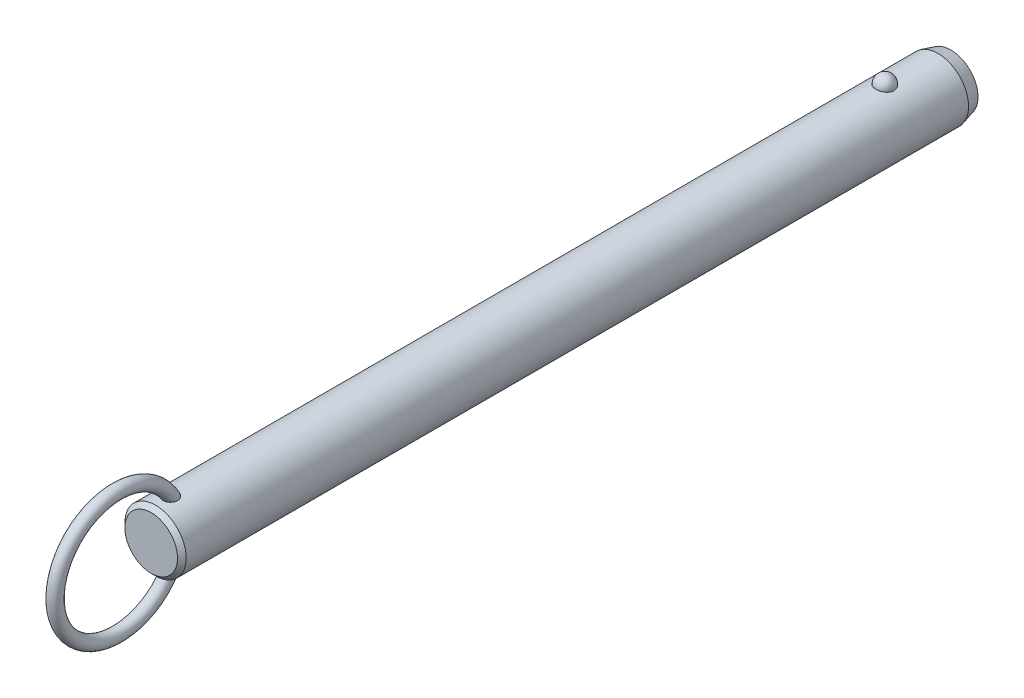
ISO-10303-21;
HEADER;
FILE_DESCRIPTION(('STEP AP214'),'2;1');
FILE_NAME('part.step','',(''),(''),'','','');
FILE_SCHEMA(('AUTOMOTIVE_DESIGN { 1 0 10303 214 1 1 1 1 }'));
ENDSEC;
DATA;
#1=APPLICATION_CONTEXT('core data for automotive mechanical design processes');
#2=APPLICATION_PROTOCOL_DEFINITION('international standard','automotive_design',2000,#1);
#3=PRODUCT_CONTEXT('',#1,'mechanical');
#4=PRODUCT('Part','Part','',(#3));
#5=PRODUCT_RELATED_PRODUCT_CATEGORY('part','',(#4));
#6=PRODUCT_DEFINITION_FORMATION('','',#4);
#7=PRODUCT_DEFINITION_CONTEXT('part definition',#1,'design');
#8=PRODUCT_DEFINITION('design','',#6,#7);
#9=PRODUCT_DEFINITION_SHAPE('','',#8);
#10=(LENGTH_UNIT() NAMED_UNIT(*) SI_UNIT(.MILLI.,.METRE.));
#11=(NAMED_UNIT(*) PLANE_ANGLE_UNIT() SI_UNIT($,.RADIAN.));
#12=(NAMED_UNIT(*) SI_UNIT($,.STERADIAN.) SOLID_ANGLE_UNIT());
#13=UNCERTAINTY_MEASURE_WITH_UNIT(LENGTH_MEASURE(1.E-05),#10,'distance_accuracy_value','');
#14=(GEOMETRIC_REPRESENTATION_CONTEXT(3) GLOBAL_UNCERTAINTY_ASSIGNED_CONTEXT((#13)) GLOBAL_UNIT_ASSIGNED_CONTEXT((#10,
#11,#12)) REPRESENTATION_CONTEXT('',''));
#15=CARTESIAN_POINT('',(0.,0.,0.));
#16=DIRECTION('',(0.,0.,1.));
#17=DIRECTION('',(1.,0.,0.));
#18=AXIS2_PLACEMENT_3D('',#15,#16,#17);
#19=CARTESIAN_POINT('',(0.,0.,160.));
#20=DIRECTION('',(0.,0.,-1.));
#21=DIRECTION('',(-1.,0.,0.));
#22=AXIS2_PLACEMENT_3D('',#19,#20,#21);
#23=CYLINDRICAL_SURFACE('',#22,7.1);
#24=CARTESIAN_POINT('',(2.0769088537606,6.78943661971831,-2.1));
#25=CARTESIAN_POINT('',(2.07690739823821,6.78943796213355,-1.98268154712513));
#26=CARTESIAN_POINT('',(2.06738130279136,6.79237331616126,-1.86534506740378));
#27=CARTESIAN_POINT('',(2.0295040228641,6.8037853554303,-1.63400788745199));
#28=CARTESIAN_POINT('',(2.00114757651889,6.81226358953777,-1.52000812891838));
#29=CARTESIAN_POINT('',(1.92632025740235,6.83379798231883,-1.29863433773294));
#30=CARTESIAN_POINT('',(1.87985726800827,6.84685214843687,-1.19125744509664));
#31=CARTESIAN_POINT('',(1.76995205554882,6.87608091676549,-0.98604657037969));
#32=CARTESIAN_POINT('',(1.70650980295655,6.8922555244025,-0.88821260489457));
#33=CARTESIAN_POINT('',(1.5638119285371,6.92602930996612,-0.704242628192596));
#34=CARTESIAN_POINT('',(1.4844714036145,6.94363582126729,-0.618173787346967));
#35=CARTESIAN_POINT('',(1.31221746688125,6.97823658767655,-0.460740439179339));
#36=CARTESIAN_POINT('',(1.21930409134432,6.99523084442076,-0.389375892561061));
#37=CARTESIAN_POINT('',(1.02268781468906,7.02666176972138,-0.263547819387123));
#38=CARTESIAN_POINT('',(0.91902009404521,7.04110638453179,-0.209031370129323));
#39=CARTESIAN_POINT('',(0.703548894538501,7.06588726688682,-0.118163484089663));
#40=CARTESIAN_POINT('',(0.591746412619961,7.07622403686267,-0.0818098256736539));
#41=CARTESIAN_POINT('',(0.365557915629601,7.09147068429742,-0.0288711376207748));
#42=CARTESIAN_POINT('',(0.251267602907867,7.09648447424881,-0.0119070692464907));
#43=CARTESIAN_POINT('',(0.0213499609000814,7.10089837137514,0.00304925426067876));
#44=CARTESIAN_POINT('',(-0.0942772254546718,7.10029907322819,0.00104351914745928));
#45=CARTESIAN_POINT('',(-0.321651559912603,7.09360829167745,-0.0216931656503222));
#46=CARTESIAN_POINT('',(-0.433431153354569,7.08760388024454,-0.0421272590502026));
#47=CARTESIAN_POINT('',(-0.651862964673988,7.07086131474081,-0.100729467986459));
#48=CARTESIAN_POINT('',(-0.758515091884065,7.06012307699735,-0.138897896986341));
#49=CARTESIAN_POINT('',(-0.964449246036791,7.03496097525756,-0.232213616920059));
#50=CARTESIAN_POINT('',(-1.06368095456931,7.02051445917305,-0.287465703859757));
#51=CARTESIAN_POINT('',(-1.25145353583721,6.98948740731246,-0.413383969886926));
#52=CARTESIAN_POINT('',(-1.33999321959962,6.97290663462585,-0.48405186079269));
#53=CARTESIAN_POINT('',(-1.50591604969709,6.93898770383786,-0.640594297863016));
#54=CARTESIAN_POINT('',(-1.58302488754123,6.92164094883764,-0.726757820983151));
#55=CARTESIAN_POINT('',(-1.72189320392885,6.8884103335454,-0.91092752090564));
#56=CARTESIAN_POINT('',(-1.78365144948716,6.87252659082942,-1.008934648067));
#57=CARTESIAN_POINT('',(-1.89101272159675,6.84377189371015,-1.21549497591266));
#58=CARTESIAN_POINT('',(-1.93639553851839,6.83094274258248,-1.32416860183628));
#59=CARTESIAN_POINT('',(-2.00874275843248,6.81002070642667,-1.54791500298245));
#60=CARTESIAN_POINT('',(-2.03570774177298,6.80192767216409,-1.66298757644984));
#61=CARTESIAN_POINT('',(-2.07047276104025,6.7914266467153,-1.89571453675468));
#62=CARTESIAN_POINT('',(-2.07835878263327,6.78899315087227,-2.01335491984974));
#63=CARTESIAN_POINT('',(-2.07502083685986,6.79001409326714,-2.24833570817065));
#64=CARTESIAN_POINT('',(-2.06379746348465,6.7934683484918,-2.36567612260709));
#65=CARTESIAN_POINT('',(-2.02263913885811,6.80583442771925,-2.59603194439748));
#66=CARTESIAN_POINT('',(-1.99281127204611,6.81471501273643,-2.70906820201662));
#67=CARTESIAN_POINT('',(-1.91526639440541,6.83691232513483,-2.92836575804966));
#68=CARTESIAN_POINT('',(-1.8675486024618,6.85022924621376,-3.03462676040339));
#69=CARTESIAN_POINT('',(-1.75504492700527,6.87991336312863,-3.23806487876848));
#70=CARTESIAN_POINT('',(-1.69015924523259,6.89629822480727,-3.33518422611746));
#71=CARTESIAN_POINT('',(-1.54505404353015,6.93024852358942,-3.51697105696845));
#72=CARTESIAN_POINT('',(-1.46483385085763,6.94781401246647,-3.60163799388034));
#73=CARTESIAN_POINT('',(-1.29071406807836,6.98225977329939,-3.75654119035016));
#74=CARTESIAN_POINT('',(-1.19675650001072,6.99913673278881,-3.82671308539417));
#75=CARTESIAN_POINT('',(-0.997940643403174,7.03023618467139,-3.9501837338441));
#76=CARTESIAN_POINT('',(-0.89308318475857,7.04445887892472,-4.00348377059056));
#77=CARTESIAN_POINT('',(-0.676902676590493,7.06848365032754,-4.09107242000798));
#78=CARTESIAN_POINT('',(-0.565686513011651,7.0783430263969,-4.12560889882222));
#79=CARTESIAN_POINT('',(-0.338739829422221,7.09282534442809,-4.17575450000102));
#80=CARTESIAN_POINT('',(-0.223009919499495,7.09744899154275,-4.19136617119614));
#81=CARTESIAN_POINT('',(0.00707628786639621,7.10090930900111,-4.20307965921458));
#82=CARTESIAN_POINT('',(0.121410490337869,7.09986531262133,-4.19958377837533));
#83=CARTESIAN_POINT('',(0.347815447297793,7.092380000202,-4.17411564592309));
#84=CARTESIAN_POINT('',(0.459886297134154,7.08593891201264,-4.15214417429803));
#85=CARTESIAN_POINT('',(0.678084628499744,7.06838983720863,-4.09049562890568));
#86=CARTESIAN_POINT('',(0.784237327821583,7.05730369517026,-4.05090137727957));
#87=CARTESIAN_POINT('',(0.988305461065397,7.03163139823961,-3.95511447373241));
#88=CARTESIAN_POINT('',(1.08622031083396,7.01704499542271,-3.89892064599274));
#89=CARTESIAN_POINT('',(1.27284490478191,6.98562668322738,-3.77035541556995));
#90=CARTESIAN_POINT('',(1.36137372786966,6.96876135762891,-3.69772964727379));
#91=CARTESIAN_POINT('',(1.52509486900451,6.93477412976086,-3.53878279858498));
#92=CARTESIAN_POINT('',(1.60028496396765,6.91765218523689,-3.45245943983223));
#93=CARTESIAN_POINT('',(1.73681688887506,6.88465753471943,-3.26658774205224));
#94=CARTESIAN_POINT('',(1.79785966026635,6.86881574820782,-3.16681408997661));
#95=CARTESIAN_POINT('',(1.90265327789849,6.84053157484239,-2.95814408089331));
#96=CARTESIAN_POINT('',(1.94640861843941,6.82808830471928,-2.84925010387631));
#97=CARTESIAN_POINT('',(2.01274378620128,6.80881460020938,-2.63454318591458));
#98=CARTESIAN_POINT('',(2.03676193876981,6.80160856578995,-2.52920574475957));
#99=CARTESIAN_POINT('',(2.06884490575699,6.79191902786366,-2.3159172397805));
#100=CARTESIAN_POINT('',(2.07691019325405,6.78943538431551,-2.20796625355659));
#101=CARTESIAN_POINT('',(2.0769088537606,6.78943661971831,-2.1));
#102=B_SPLINE_CURVE_WITH_KNOTS('',3,(#24,#25,#26,#27,#28,#29,#30,#31,#32,#33,#34,#35,#36,#37,
#38,#39,#40,#41,#42,#43,#44,#45,#46,#47,#48,#49,#50,#51,#52,#53,#54,#55,#56,#57,#58,#59,#60,#61,
#62,#63,#64,#65,#66,#67,#68,#69,#70,#71,#72,#73,#74,#75,#76,#77,#78,#79,#80,#81,#82,#83,#84,#85,
#86,#87,#88,#89,#90,#91,#92,#93,#94,#95,#96,#97,#98,#99,#100,#101),.UNSPECIFIED.,.T.,.F.,(4,2,2,
2,2,2,2,2,2,2,2,2,2,2,2,2,2,2,2,2,2,2,2,2,2,2,2,2,2,2,2,2,2,2,2,2,2,2,4),(0.,0.351568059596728,
0.703234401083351,1.05474780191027,1.40626181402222,1.75970563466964,2.11314851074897,
2.4654696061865,2.81774759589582,3.16301449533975,3.50824481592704,3.84801136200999,
4.18778391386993,4.52968352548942,4.87162112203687,5.22076181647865,5.56993054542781,
5.92363364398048,6.27732559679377,6.62942052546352,6.98150450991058,7.33158042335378,
7.68167162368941,8.03384443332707,8.38603269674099,8.73975272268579,9.09344583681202,
9.44234545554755,9.79119807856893,10.1327344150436,10.4742563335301,10.8141898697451,
11.1541474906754,11.4997793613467,11.8454687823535,12.1979079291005,12.5502553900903,
12.8738073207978,13.1973496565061),.UNSPECIFIED.);
#103=CARTESIAN_POINT('',(2.0769088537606,6.78943661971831,-2.1));
#104=VERTEX_POINT('',#103);
#105=EDGE_CURVE('E41',#104,#104,#102,.T.);
#106=ORIENTED_EDGE('',*,*,#105,.T.);
#107=EDGE_LOOP('',(#106));
#108=FACE_BOUND('',#107,.T.);
#109=CARTESIAN_POINT('',(0.,0.,166.92));
#110=DIRECTION('',(0.,0.,1.));
#111=DIRECTION('',(1.,0.,0.));
#112=AXIS2_PLACEMENT_3D('',#109,#110,#111);
#113=CIRCLE('',#112,7.1);
#114=CARTESIAN_POINT('',(7.1,0.,166.92));
#115=VERTEX_POINT('',#114);
#116=EDGE_CURVE('E10',#115,#115,#113,.F.);
#117=ORIENTED_EDGE('',*,*,#116,.T.);
#118=EDGE_LOOP('',(#117));
#119=FACE_BOUND('',#118,.T.);
#120=CARTESIAN_POINT('',(-0.429539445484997,-7.08699541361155,161.742921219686));
#121=CARTESIAN_POINT('',(-0.508331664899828,-7.08221999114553,161.766876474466));
#122=CARTESIAN_POINT('',(-0.585039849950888,-7.07624016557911,161.797457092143));
#123=CARTESIAN_POINT('',(-0.73208265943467,-7.06254296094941,161.871024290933));
#124=CARTESIAN_POINT('',(-0.802417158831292,-7.05482554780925,161.914011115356));
#125=CARTESIAN_POINT('',(-0.934722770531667,-7.03851844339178,162.011113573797));
#126=CARTESIAN_POINT('',(-0.996700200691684,-7.02992941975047,162.065220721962));
#127=CARTESIAN_POINT('',(-1.11079942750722,-7.01280697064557,162.182967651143));
#128=CARTESIAN_POINT('',(-1.16292136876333,-7.00427354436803,162.246607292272));
#129=CARTESIAN_POINT('',(-1.25705660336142,-6.98799959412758,162.382687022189));
#130=CARTESIAN_POINT('',(-1.29888032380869,-6.98027525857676,162.455259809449));
#131=CARTESIAN_POINT('',(-1.37069920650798,-6.96652886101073,162.606168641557));
#132=CARTESIAN_POINT('',(-1.40069157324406,-6.96050720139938,162.684506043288));
#133=CARTESIAN_POINT('',(-1.45043507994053,-6.95031881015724,162.850190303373));
#134=CARTESIAN_POINT('',(-1.46937115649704,-6.94630231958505,162.937789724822));
#135=CARTESIAN_POINT('',(-1.49424917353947,-6.94099239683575,163.114871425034));
#136=CARTESIAN_POINT('',(-1.50018601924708,-6.93970003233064,163.204354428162));
#137=CARTESIAN_POINT('',(-1.49978214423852,-6.93978815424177,163.394060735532));
#138=CARTESIAN_POINT('',(-1.49187639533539,-6.94150934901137,163.494279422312));
#139=CARTESIAN_POINT('',(-1.46177925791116,-6.94790814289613,163.692479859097));
#140=CARTESIAN_POINT('',(-1.43957541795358,-6.95258831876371,163.790459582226));
#141=CARTESIAN_POINT('',(-1.37783293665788,-6.96510647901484,163.99536292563));
#142=CARTESIAN_POINT('',(-1.33634073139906,-6.97328848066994,164.101680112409));
#143=CARTESIAN_POINT('',(-1.23686994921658,-6.99161706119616,164.306177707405));
#144=CARTESIAN_POINT('',(-1.17889192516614,-7.00176357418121,164.404358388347));
#145=CARTESIAN_POINT('',(-1.05875124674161,-7.02082898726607,164.572374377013));
#146=CARTESIAN_POINT('',(-0.999247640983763,-7.02963746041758,164.644123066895));
#147=CARTESIAN_POINT('',(-0.869494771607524,-7.04686074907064,164.777195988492));
#148=CARTESIAN_POINT('',(-0.799263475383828,-7.05527619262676,164.838537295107));
#149=CARTESIAN_POINT('',(-0.665408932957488,-7.06899457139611,164.935131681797));
#150=CARTESIAN_POINT('',(-0.603817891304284,-7.07457275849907,164.973151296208));
#151=CARTESIAN_POINT('',(-0.475172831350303,-7.08437420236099,165.038758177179));
#152=CARTESIAN_POINT('',(-0.408123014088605,-7.08859848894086,165.066353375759));
#153=CARTESIAN_POINT('',(-0.269431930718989,-7.09522749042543,165.109256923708));
#154=CARTESIAN_POINT('',(-0.197757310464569,-7.09761688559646,165.124461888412));
#155=CARTESIAN_POINT('',(-0.0527849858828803,-7.10017268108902,165.140716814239));
#156=CARTESIAN_POINT('',(0.0205115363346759,-7.10034065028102,165.141776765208));
#157=CARTESIAN_POINT('',(0.156426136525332,-7.09855986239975,165.130461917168));
#158=CARTESIAN_POINT('',(0.219199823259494,-7.09688191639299,165.119806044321));
#159=CARTESIAN_POINT('',(0.342134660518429,-7.09201880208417,165.088537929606));
#160=CARTESIAN_POINT('',(0.402295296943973,-7.08883333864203,165.067923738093));
#161=CARTESIAN_POINT('',(0.520687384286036,-7.08113868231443,165.017212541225));
#162=CARTESIAN_POINT('',(0.578791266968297,-7.07658958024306,164.986827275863));
#163=CARTESIAN_POINT('',(0.690173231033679,-7.06659708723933,164.918367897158));
#164=CARTESIAN_POINT('',(0.743447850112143,-7.061153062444,164.880288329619));
#165=CARTESIAN_POINT('',(0.870947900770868,-7.04680292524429,164.776592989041));
#166=CARTESIAN_POINT('',(0.941828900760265,-7.03755800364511,164.706897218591));
#167=CARTESIAN_POINT('',(1.07136606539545,-7.01900793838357,164.556945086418));
#168=CARTESIAN_POINT('',(1.13000013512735,-7.00970271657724,164.476670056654));
#169=CARTESIAN_POINT('',(1.23579584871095,-6.99183327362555,164.306899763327));
#170=CARTESIAN_POINT('',(1.28274271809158,-6.98328455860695,164.217269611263));
#171=CARTESIAN_POINT('',(1.36351442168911,-6.96796352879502,164.032176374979));
#172=CARTESIAN_POINT('',(1.39733971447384,-6.96119115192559,163.936713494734));
#173=CARTESIAN_POINT('',(1.45579181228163,-6.94922464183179,163.72530928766));
#174=CARTESIAN_POINT('',(1.47790145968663,-6.94449000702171,163.608631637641));
#175=CARTESIAN_POINT('',(1.50168752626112,-6.93938731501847,163.373015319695));
#176=CARTESIAN_POINT('',(1.50336085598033,-6.93901991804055,163.25407631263));
#177=CARTESIAN_POINT('',(1.48486516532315,-6.9430010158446,163.02360799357));
#178=CARTESIAN_POINT('',(1.46573441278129,-6.9471253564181,162.911995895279));
#179=CARTESIAN_POINT('',(1.40606892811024,-6.95944667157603,162.694886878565));
#180=CARTESIAN_POINT('',(1.36556446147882,-6.96763788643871,162.5893815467));
#181=CARTESIAN_POINT('',(1.2708270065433,-6.98548038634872,162.404287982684));
#182=CARTESIAN_POINT('',(1.21949810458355,-6.99473841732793,162.323171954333));
#183=CARTESIAN_POINT('',(1.10242050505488,-7.01414069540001,162.172227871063));
#184=CARTESIAN_POINT('',(1.03668119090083,-7.02428436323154,162.10239252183));
#185=CARTESIAN_POINT('',(0.900559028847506,-7.04295285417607,161.983573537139));
#186=CARTESIAN_POINT('',(0.831428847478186,-7.05153466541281,161.933157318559));
#187=CARTESIAN_POINT('',(0.685291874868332,-7.06723150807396,161.845142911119));
#188=CARTESIAN_POINT('',(0.608287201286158,-7.07434693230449,161.807541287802));
#189=CARTESIAN_POINT('',(0.451878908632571,-7.08602232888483,161.747491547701));
#190=CARTESIAN_POINT('',(0.372686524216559,-7.09067127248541,161.724508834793));
#191=CARTESIAN_POINT('',(0.21147739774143,-7.09730788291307,161.692035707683));
#192=CARTESIAN_POINT('',(0.129460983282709,-7.09929585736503,161.68254373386));
#193=CARTESIAN_POINT('',(-0.0332905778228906,-7.10037858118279,161.677351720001));
#194=CARTESIAN_POINT('',(-0.114016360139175,-7.09953334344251,161.681365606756));
#195=CARTESIAN_POINT('',(-0.273670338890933,-7.09517338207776,161.702454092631));
#196=CARTESIAN_POINT('',(-0.352598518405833,-7.09165863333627,161.719528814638));
#197=CARTESIAN_POINT('',(-0.429539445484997,-7.08699541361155,161.742921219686));
#198=B_SPLINE_CURVE_WITH_KNOTS('',3,(#120,#121,#122,#123,#124,#125,#126,#127,#128,#129,#130,
#131,#132,#133,#134,#135,#136,#137,#138,#139,#140,#141,#142,#143,#144,#145,#146,#147,#148,#149,
#150,#151,#152,#153,#154,#155,#156,#157,#158,#159,#160,#161,#162,#163,#164,#165,#166,#167,#168,
#169,#170,#171,#172,#173,#174,#175,#176,#177,#178,#179,#180,#181,#182,#183,#184,#185,#186,#187,
#188,#189,#190,#191,#192,#193,#194,#195,#196,#197),.UNSPECIFIED.,.T.,.F.,(4,2,2,2,2,2,2,2,2,2,2,
2,2,2,2,2,2,2,2,2,2,2,2,2,2,2,2,2,2,2,2,2,2,2,2,2,2,2,4),(0.,0.247183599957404,
0.494372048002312,0.741372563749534,0.988369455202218,1.23962059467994,1.490931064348,
1.75897818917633,2.02713035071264,2.32758265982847,2.62829697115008,2.97008736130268,
3.31186629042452,3.59175319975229,3.87117637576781,4.08813841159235,4.30493502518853,
4.5235225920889,4.74195577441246,4.93215328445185,5.12238804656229,5.31884850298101,
5.51544871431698,5.81332317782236,6.11173048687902,6.41527266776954,6.71880423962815,
7.07358156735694,7.42841252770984,7.76631485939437,8.10373999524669,8.39142246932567,
8.67891817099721,8.93560332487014,9.19221962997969,9.43881106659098,9.68537399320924,
9.92674752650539,10.1681233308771),.UNSPECIFIED.);
#199=CARTESIAN_POINT('',(-0.429539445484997,-7.08699541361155,161.742921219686));
#200=VERTEX_POINT('',#199);
#201=EDGE_CURVE('E60',#200,#200,#198,.T.);
#202=ORIENTED_EDGE('',*,*,#201,.T.);
#203=EDGE_LOOP('',(#202));
#204=FACE_BOUND('',#203,.T.);
#205=CARTESIAN_POINT('',(-0.429539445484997,7.08699541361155,161.742921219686));
#206=CARTESIAN_POINT('',(-0.351665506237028,7.09171429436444,161.719246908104));
#207=CARTESIAN_POINT('',(-0.271733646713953,7.09525896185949,161.702036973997));
#208=CARTESIAN_POINT('',(-0.110026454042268,7.09960839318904,161.681005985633));
#209=CARTESIAN_POINT('',(-0.0282502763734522,7.10041187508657,161.677191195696));
#210=CARTESIAN_POINT('',(0.134782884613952,7.09918849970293,161.683059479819));
#211=CARTESIAN_POINT('',(0.216039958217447,7.09716214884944,161.69274013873));
#212=CARTESIAN_POINT('',(0.375730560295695,7.09050177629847,161.725347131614));
#213=CARTESIAN_POINT('',(0.454164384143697,7.08586802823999,161.748272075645));
#214=CARTESIAN_POINT('',(0.606025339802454,7.07449911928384,161.806771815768));
#215=CARTESIAN_POINT('',(0.67945100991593,7.06776334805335,161.842350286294));
#216=CARTESIAN_POINT('',(0.819234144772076,7.05292866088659,161.925175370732));
#217=CARTESIAN_POINT('',(0.88559181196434,7.04482978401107,161.972421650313));
#218=CARTESIAN_POINT('',(1.00993211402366,7.02808709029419,162.077590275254));
#219=CARTESIAN_POINT('',(1.06785399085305,7.01943990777,162.135583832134));
#220=CARTESIAN_POINT('',(1.17342527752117,7.00256662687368,162.260301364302));
#221=CARTESIAN_POINT('',(1.22107408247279,6.99434055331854,162.327025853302));
#222=CARTESIAN_POINT('',(1.30652927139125,6.97889183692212,162.469362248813));
#223=CARTESIAN_POINT('',(1.34399711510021,6.97170674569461,162.545180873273));
#224=CARTESIAN_POINT('',(1.40682616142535,6.95930080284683,162.701810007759));
#225=CARTESIAN_POINT('',(1.43218374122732,6.95408053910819,162.78262200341));
#226=CARTESIAN_POINT('',(1.47246409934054,6.94566853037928,162.953531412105));
#227=CARTESIAN_POINT('',(1.48642590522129,6.9426653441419,163.04386307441));
#228=CARTESIAN_POINT('',(1.5011410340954,6.93949744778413,163.225619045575));
#229=CARTESIAN_POINT('',(1.50188917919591,6.93933385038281,163.317043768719));
#230=CARTESIAN_POINT('',(1.49030464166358,6.94183245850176,163.51084381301));
#231=CARTESIAN_POINT('',(1.47627413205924,6.94486147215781,163.613112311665));
#232=CARTESIAN_POINT('',(1.43356351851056,6.95380194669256,163.814471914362));
#233=CARTESIAN_POINT('',(1.4048676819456,6.95971650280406,163.913559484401));
#234=CARTESIAN_POINT('',(1.32908750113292,6.97461208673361,164.118908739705));
#235=CARTESIAN_POINT('',(1.28011435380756,6.98388945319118,164.224456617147));
#236=CARTESIAN_POINT('',(1.16520357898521,7.00397743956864,164.425760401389));
#237=CARTESIAN_POINT('',(1.09927694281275,7.01478706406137,164.521522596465));
#238=CARTESIAN_POINT('',(0.969361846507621,7.03373936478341,164.676756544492));
#239=CARTESIAN_POINT('',(0.909042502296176,7.04187023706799,164.739303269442));
#240=CARTESIAN_POINT('',(0.779178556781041,7.05741732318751,164.854053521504));
#241=CARTESIAN_POINT('',(0.709649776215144,7.06483472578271,164.906274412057));
#242=CARTESIAN_POINT('',(0.576854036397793,7.0767751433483,164.988113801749));
#243=CARTESIAN_POINT('',(0.515118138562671,7.08158033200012,165.020164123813));
#244=CARTESIAN_POINT('',(0.387127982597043,7.08972701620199,165.073765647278));
#245=CARTESIAN_POINT('',(0.320877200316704,7.09306962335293,165.095324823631));
#246=CARTESIAN_POINT('',(0.185041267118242,7.09791507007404,165.126400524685));
#247=CARTESIAN_POINT('',(0.115437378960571,7.09940591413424,165.135838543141));
#248=CARTESIAN_POINT('',(-0.0243157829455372,7.10030171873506,165.141522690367));
#249=CARTESIAN_POINT('',(-0.0944648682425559,7.0997073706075,165.137773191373));
#250=CARTESIAN_POINT('',(-0.225713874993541,7.09668414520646,165.118508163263));
#251=CARTESIAN_POINT('',(-0.287006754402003,7.09444865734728,165.104232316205));
#252=CARTESIAN_POINT('',(-0.406555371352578,7.08860360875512,165.066368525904));
#253=CARTESIAN_POINT('',(-0.464809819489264,7.08499346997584,165.042776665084));
#254=CARTESIAN_POINT('',(-0.594955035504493,7.07541654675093,164.978923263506));
#255=CARTESIAN_POINT('',(-0.665389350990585,7.06906574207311,164.935753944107));
#256=CARTESIAN_POINT('',(-0.798242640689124,7.05530261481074,164.838587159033));
#257=CARTESIAN_POINT('',(-0.860645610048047,7.0478882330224,164.784568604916));
#258=CARTESIAN_POINT('',(-0.994249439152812,7.03045217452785,164.650996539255));
#259=CARTESIAN_POINT('',(-1.06260129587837,7.02030745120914,164.568614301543));
#260=CARTESIAN_POINT('',(-1.18502045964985,7.00068382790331,164.393843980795));
#261=CARTESIAN_POINT('',(-1.23907684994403,6.99120544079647,164.301448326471));
#262=CARTESIAN_POINT('',(-1.33335589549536,6.97384343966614,164.108008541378));
#263=CARTESIAN_POINT('',(-1.37336138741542,6.96598557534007,164.006856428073));
#264=CARTESIAN_POINT('',(-1.43770677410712,6.95299053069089,163.799504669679));
#265=CARTESIAN_POINT('',(-1.46204473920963,6.94785368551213,163.69330440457));
#266=CARTESIAN_POINT('',(-1.49537533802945,6.94076296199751,163.468231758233));
#267=CARTESIAN_POINT('',(-1.50273564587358,6.93914842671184,163.34909751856));
#268=CARTESIAN_POINT('',(-1.4954555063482,6.94072368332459,163.111470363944));
#269=CARTESIAN_POINT('',(-1.48082914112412,6.94391040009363,162.992977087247));
#270=CARTESIAN_POINT('',(-1.43076401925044,6.95438579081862,162.773432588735));
#271=CARTESIAN_POINT('',(-1.3976222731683,6.96121852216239,162.671841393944));
#272=CARTESIAN_POINT('',(-1.31211274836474,6.97783941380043,162.477351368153));
#273=CARTESIAN_POINT('',(-1.25976607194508,6.98762432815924,162.38444313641));
#274=CARTESIAN_POINT('',(-1.14583073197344,7.00713153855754,162.224160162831));
#275=CARTESIAN_POINT('',(-1.08665947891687,7.01665982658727,162.155035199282));
#276=CARTESIAN_POINT('',(-0.95660664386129,7.03556646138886,162.028878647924));
#277=CARTESIAN_POINT('',(-0.88573712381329,7.04494495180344,161.971834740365));
#278=CARTESIAN_POINT('',(-0.751558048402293,7.06035735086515,161.883100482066));
#279=CARTESIAN_POINT('',(-0.690120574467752,7.0666695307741,161.848593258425));
#280=CARTESIAN_POINT('',(-0.562815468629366,7.07794609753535,161.788750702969));
#281=CARTESIAN_POINT('',(-0.496948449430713,7.08291067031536,161.763414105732));
#282=CARTESIAN_POINT('',(-0.429539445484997,7.08699541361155,161.742921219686));
#283=B_SPLINE_CURVE_WITH_KNOTS('',3,(#205,#206,#207,#208,#209,#210,#211,#212,#213,#214,#215,
#216,#217,#218,#219,#220,#221,#222,#223,#224,#225,#226,#227,#228,#229,#230,#231,#232,#233,#234,
#235,#236,#237,#238,#239,#240,#241,#242,#243,#244,#245,#246,#247,#248,#249,#250,#251,#252,#253,
#254,#255,#256,#257,#258,#259,#260,#261,#262,#263,#264,#265,#266,#267,#268,#269,#270,#271,#272,
#273,#274,#275,#276,#277,#278,#279,#280,#281,#282),.UNSPECIFIED.,.T.,.F.,(4,2,2,2,2,2,2,2,2,2,2,
2,2,2,2,2,2,2,2,2,2,2,2,2,2,2,2,2,2,2,2,2,2,2,2,2,2,2,4),(0.,0.244335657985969,
0.488785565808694,0.733191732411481,0.977572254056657,1.2220237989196,1.46646834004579,
1.71259457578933,1.9587352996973,2.21226768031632,2.46587585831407,2.73913816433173,
3.01250754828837,3.32109936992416,3.63002293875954,3.9786351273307,4.32702187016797,
4.58793945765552,4.84841449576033,5.05676704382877,5.26496096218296,5.47449661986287,
5.68396281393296,5.87205447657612,6.06022532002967,6.30743751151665,6.55513496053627,
6.87602468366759,7.1971587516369,7.52305774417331,7.84899686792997,8.2051615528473,
8.56109821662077,8.88040084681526,9.19935367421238,9.47236282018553,9.74509220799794,
9.95662250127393,10.1681235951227),.UNSPECIFIED.);
#284=CARTESIAN_POINT('',(-0.429539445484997,7.08699541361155,161.742921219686));
#285=VERTEX_POINT('',#284);
#286=EDGE_CURVE('E68',#285,#285,#283,.T.);
#287=ORIENTED_EDGE('',*,*,#286,.T.);
#288=EDGE_LOOP('',(#287));
#289=FACE_BOUND('',#288,.T.);
#290=CARTESIAN_POINT('',(0.,0.,-14.3999999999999));
#291=DIRECTION('',(0.,0.,-1.));
#292=DIRECTION('',(-1.,0.,0.));
#293=AXIS2_PLACEMENT_3D('',#290,#291,#292);
#294=CIRCLE('',#293,7.1);
#295=CARTESIAN_POINT('',(-7.1,0.,-14.3999999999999));
#296=VERTEX_POINT('',#295);
#297=EDGE_CURVE('E57',#296,#296,#294,.F.);
#298=ORIENTED_EDGE('',*,*,#297,.T.);
#299=EDGE_LOOP('',(#298));
#300=FACE_BOUND('',#299,.T.);
#301=ADVANCED_FACE('F37',(#108,#119,#204,#289,#300),#23,.T.);
#302=CARTESIAN_POINT('',(0.,0.,-17.4));
#303=DIRECTION('',(0.,0.,-1.));
#304=DIRECTION('',(-1.,0.,0.));
#305=AXIS2_PLACEMENT_3D('',#302,#303,#304);
#306=PLANE('',#305);
#307=CARTESIAN_POINT('',(0.,0.,-17.4));
#308=DIRECTION('',(0.,0.,-1.));
#309=DIRECTION('',(-1.,0.,0.));
#310=AXIS2_PLACEMENT_3D('',#307,#308,#309);
#311=CIRCLE('',#310,6.29615242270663);
#312=CARTESIAN_POINT('',(-6.29615242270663,0.,-17.4));
#313=VERTEX_POINT('',#312);
#314=EDGE_CURVE('E67',#313,#313,#311,.T.);
#315=ORIENTED_EDGE('',*,*,#314,.T.);
#316=EDGE_LOOP('',(#315));
#317=FACE_BOUND('',#316,.T.);
#318=ADVANCED_FACE('F86',(#317),#306,.T.);
#319=CARTESIAN_POINT('',(0.,0.,-17.4));
#320=DIRECTION('',(0.,0.,1.));
#321=DIRECTION('',(1.,0.,0.));
#322=AXIS2_PLACEMENT_3D('',#319,#320,#321);
#323=CONICAL_SURFACE('',#322,6.29615242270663,0.261799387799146);
#324=ORIENTED_EDGE('',*,*,#297,.F.);
#325=EDGE_LOOP('',(#324));
#326=FACE_BOUND('',#325,.T.);
#327=ORIENTED_EDGE('',*,*,#314,.F.);
#328=EDGE_LOOP('',(#327));
#329=FACE_BOUND('',#328,.T.);
#330=ADVANCED_FACE('F84',(#326,#329),#323,.T.);
#331=CARTESIAN_POINT('',(0.,0.,167.92));
#332=DIRECTION('',(0.,0.,1.));
#333=DIRECTION('',(1.,0.,0.));
#334=AXIS2_PLACEMENT_3D('',#331,#332,#333);
#335=PLANE('',#334);
#336=CARTESIAN_POINT('',(0.,0.,167.92));
#337=DIRECTION('',(0.,0.,1.));
#338=DIRECTION('',(1.,0.,0.));
#339=AXIS2_PLACEMENT_3D('',#336,#337,#338);
#340=CIRCLE('',#339,6.10000000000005);
#341=CARTESIAN_POINT('',(6.10000000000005,0.,167.92));
#342=VERTEX_POINT('',#341);
#343=EDGE_CURVE('E50',#342,#342,#340,.T.);
#344=ORIENTED_EDGE('',*,*,#343,.T.);
#345=EDGE_LOOP('',(#344));
#346=FACE_BOUND('',#345,.T.);
#347=ADVANCED_FACE('F78',(#346),#335,.T.);
#348=CARTESIAN_POINT('',(0.,0.,175.85));
#349=DIRECTION('',(1.,0.,0.));
#350=DIRECTION('',(0.,0.,-1.));
#351=AXIS2_PLACEMENT_3D('',#348,#349,#350);
#352=TOROIDAL_SURFACE('',#351,14.35,1.5);
#353=ORIENTED_EDGE('',*,*,#286,.F.);
#354=EDGE_LOOP('',(#353));
#355=FACE_BOUND('',#354,.T.);
#356=ORIENTED_EDGE('',*,*,#201,.F.);
#357=EDGE_LOOP('',(#356));
#358=FACE_BOUND('',#357,.T.);
#359=ADVANCED_FACE('F74',(#355,#358),#352,.T.);
#360=CARTESIAN_POINT('',(0.,0.,167.92));
#361=DIRECTION('',(0.,0.,-1.));
#362=DIRECTION('',(-1.,0.,0.));
#363=AXIS2_PLACEMENT_3D('',#360,#361,#362);
#364=CONICAL_SURFACE('',#363,6.10000000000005,0.78539816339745);
#365=ORIENTED_EDGE('',*,*,#116,.F.);
#366=EDGE_LOOP('',(#365));
#367=FACE_BOUND('',#366,.T.);
#368=ORIENTED_EDGE('',*,*,#343,.F.);
#369=EDGE_LOOP('',(#368));
#370=FACE_BOUND('',#369,.T.);
#371=ADVANCED_FACE('F39',(#367,#370),#364,.T.);
#372=CARTESIAN_POINT('',(0.,7.1,-2.1));
#373=DIRECTION('',(0.,1.,0.));
#374=DIRECTION('',(0.,0.,1.));
#375=AXIS2_PLACEMENT_3D('',#372,#373,#374);
#376=SPHERICAL_SURFACE('',#375,2.10000000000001);
#377=ORIENTED_EDGE('',*,*,#105,.F.);
#378=EDGE_LOOP('',(#377));
#379=FACE_BOUND('',#378,.T.);
#380=ADVANCED_FACE('F80',(#379),#376,.T.);
#381=CLOSED_SHELL('',(#301,#318,#330,#347,#359,#371,#380));
#382=MANIFOLD_SOLID_BREP('B2',#381);
#383=ADVANCED_BREP_SHAPE_REPRESENTATION('',(#18,#382),#14);
#384=SHAPE_DEFINITION_REPRESENTATION(#9,#383);
ENDSEC;
END-ISO-10303-21;
